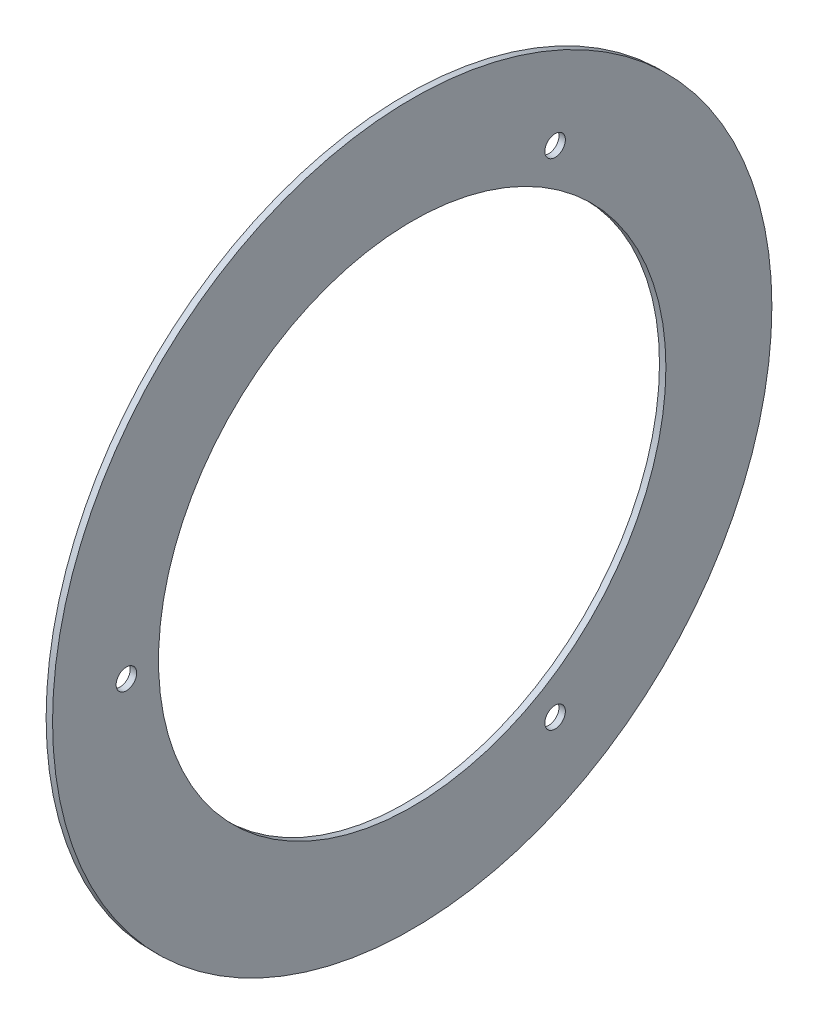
from build123d import *

# Parameters (mm, degrees)
SKIZZE1_R                        = 56
SKIZZE1_R_2                      = 39.5
LINEAR_AUSTRAGEN1_DEPTH          = 1
F_3_2_3_2_DURCHMESSER_BOHRUNG1_D = 3.2


with BuildPart() as part:
    # Skizze1 → Linear austragen1 (new body)
    with BuildSketch(Plane(origin=(0, 0, 0), x_dir=(0, 0, -1), z_dir=(1, 0, 0))):
        Circle(SKIZZE1_R)
        Circle(SKIZZE1_R_2, mode=Mode.SUBTRACT)
    extrude(amount=LINEAR_AUSTRAGEN1_DEPTH)

    # 3.2 _3.2_ Durchmesser Bohrung1 (through all)
    with Locations(Plane(origin=(1, 0, 0), x_dir=(0, 0, -1), z_dir=(1, 0, 0))):
        with Locations((22.25, 38.538130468), (-44.5, 0), (22.25, -38.538130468)):
            Hole(F_3_2_3_2_DURCHMESSER_BOHRUNG1_D / 2)


solid = part.part
